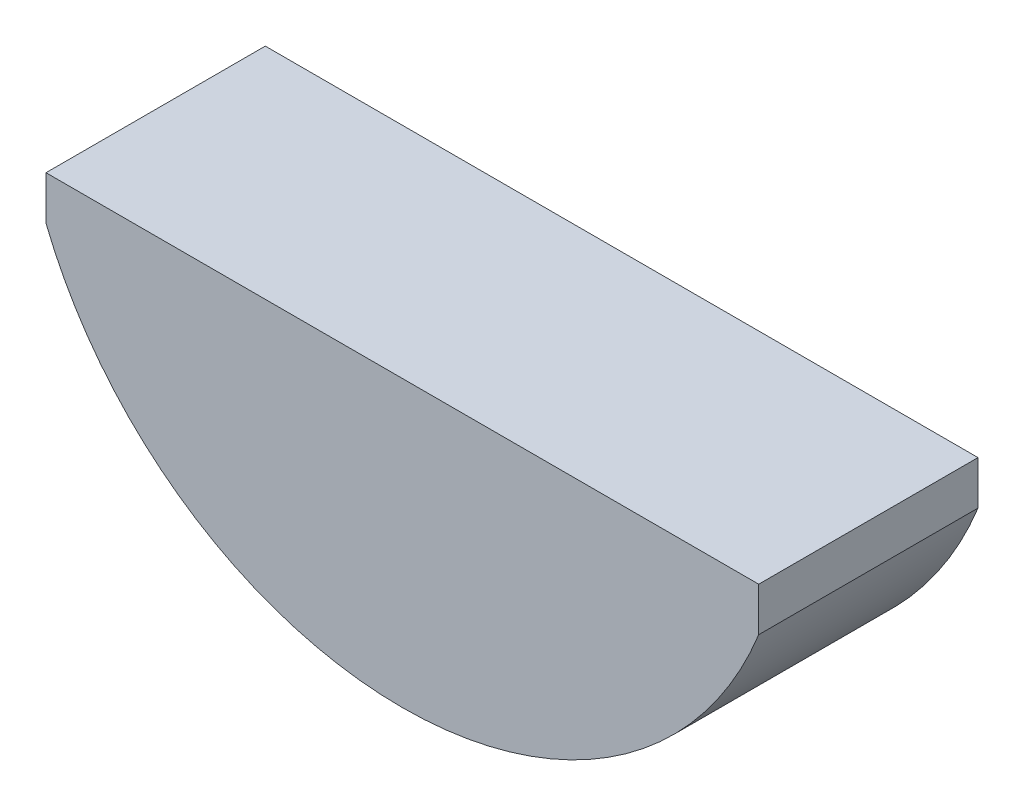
ISO-10303-21;
HEADER;
FILE_DESCRIPTION(('STEP AP214'),'2;1');
FILE_NAME('part.step','',(''),(''),'','','');
FILE_SCHEMA(('AUTOMOTIVE_DESIGN { 1 0 10303 214 1 1 1 1 }'));
ENDSEC;
DATA;
#1=APPLICATION_CONTEXT('core data for automotive mechanical design processes');
#2=APPLICATION_PROTOCOL_DEFINITION('international standard','automotive_design',2000,#1);
#3=PRODUCT_CONTEXT('',#1,'mechanical');
#4=PRODUCT('Part','Part','',(#3));
#5=PRODUCT_RELATED_PRODUCT_CATEGORY('part','',(#4));
#6=PRODUCT_DEFINITION_FORMATION('','',#4);
#7=PRODUCT_DEFINITION_CONTEXT('part definition',#1,'design');
#8=PRODUCT_DEFINITION('design','',#6,#7);
#9=PRODUCT_DEFINITION_SHAPE('','',#8);
#10=(LENGTH_UNIT() NAMED_UNIT(*) SI_UNIT(.MILLI.,.METRE.));
#11=(NAMED_UNIT(*) PLANE_ANGLE_UNIT() SI_UNIT($,.RADIAN.));
#12=(NAMED_UNIT(*) SI_UNIT($,.STERADIAN.) SOLID_ANGLE_UNIT());
#13=UNCERTAINTY_MEASURE_WITH_UNIT(LENGTH_MEASURE(1.E-05),#10,'distance_accuracy_value','');
#14=(GEOMETRIC_REPRESENTATION_CONTEXT(3) GLOBAL_UNCERTAINTY_ASSIGNED_CONTEXT((#13)) GLOBAL_UNIT_ASSIGNED_CONTEXT((#10,
#11,#12)) REPRESENTATION_CONTEXT('',''));
#15=CARTESIAN_POINT('',(0.,0.,0.));
#16=DIRECTION('',(0.,0.,1.));
#17=DIRECTION('',(1.,0.,0.));
#18=AXIS2_PLACEMENT_3D('',#15,#16,#17);
#19=CARTESIAN_POINT('',(1.11022302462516E-13,-4.44089209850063E-13,1.00000000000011));
#20=DIRECTION('',(0.,0.,-1.));
#21=DIRECTION('',(-1.,0.,0.));
#22=AXIS2_PLACEMENT_3D('',#19,#20,#21);
#23=CYLINDRICAL_SURFACE('',#22,3.5);
#24=DIRECTION('',(0.,0.,-1.));
#25=VECTOR('',#24,1.);
#26=CARTESIAN_POINT('',(3.25000000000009,-1.29903810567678,1.00000000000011));
#27=LINE('',#26,#25);
#28=CARTESIAN_POINT('',(3.25000000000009,-1.29903810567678,1.00000000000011));
#29=VERTEX_POINT('',#28);
#30=CARTESIAN_POINT('',(3.25000000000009,-1.299038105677,-0.999999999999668));
#31=VERTEX_POINT('',#30);
#32=EDGE_CURVE('E11',#29,#31,#27,.T.);
#33=ORIENTED_EDGE('',*,*,#32,.F.);
#34=CARTESIAN_POINT('',(1.11022302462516E-13,-4.44089209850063E-13,1.00000000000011));
#35=DIRECTION('',(0.,0.,1.));
#36=DIRECTION('',(1.,0.,0.));
#37=AXIS2_PLACEMENT_3D('',#34,#35,#36);
#38=CIRCLE('',#37,3.5);
#39=CARTESIAN_POINT('',(-3.24999999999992,-1.29903810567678,1.00000000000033));
#40=VERTEX_POINT('',#39);
#41=EDGE_CURVE('E90',#40,#29,#38,.T.);
#42=ORIENTED_EDGE('',*,*,#41,.F.);
#43=DIRECTION('',(0.,0.,-1.));
#44=VECTOR('',#43,1.);
#45=CARTESIAN_POINT('',(-3.24999999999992,-1.29903810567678,1.00000000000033));
#46=LINE('',#45,#44);
#47=CARTESIAN_POINT('',(-3.24999999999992,-1.299038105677,-0.999999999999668));
#48=VERTEX_POINT('',#47);
#49=EDGE_CURVE('E72',#40,#48,#46,.T.);
#50=ORIENTED_EDGE('',*,*,#49,.T.);
#51=CARTESIAN_POINT('',(0.,-2.22044604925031E-13,-0.99999999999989));
#52=DIRECTION('',(0.,0.,1.));
#53=DIRECTION('',(1.,0.,0.));
#54=AXIS2_PLACEMENT_3D('',#51,#52,#53);
#55=CIRCLE('',#54,3.5);
#56=EDGE_CURVE('E84',#48,#31,#55,.T.);
#57=ORIENTED_EDGE('',*,*,#56,.T.);
#58=EDGE_LOOP('',(#33,#42,#50,#57));
#59=FACE_BOUND('',#58,.T.);
#60=ADVANCED_FACE('F30',(#59),#23,.T.);
#61=CARTESIAN_POINT('',(3.25000000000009,-1.29903810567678,1.00000000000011));
#62=DIRECTION('',(-1.,0.,0.));
#63=DIRECTION('',(0.,0.,1.));
#64=AXIS2_PLACEMENT_3D('',#61,#62,#63);
#65=PLANE('',#64);
#66=DIRECTION('',(0.,0.,-1.));
#67=VECTOR('',#66,1.);
#68=CARTESIAN_POINT('',(3.25000000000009,-0.900000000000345,1.00000000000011));
#69=LINE('',#68,#67);
#70=CARTESIAN_POINT('',(3.25000000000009,-0.900000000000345,1.00000000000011));
#71=VERTEX_POINT('',#70);
#72=CARTESIAN_POINT('',(3.25000000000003,-0.900000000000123,-0.999999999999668));
#73=VERTEX_POINT('',#72);
#74=EDGE_CURVE('E39',#71,#73,#69,.T.);
#75=ORIENTED_EDGE('',*,*,#74,.F.);
#76=DIRECTION('',(0.,1.,0.));
#77=VECTOR('',#76,1.);
#78=CARTESIAN_POINT('',(3.25000000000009,-1.29903810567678,1.00000000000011));
#79=LINE('',#78,#77);
#80=EDGE_CURVE('E80',#29,#71,#79,.T.);
#81=ORIENTED_EDGE('',*,*,#80,.F.);
#82=ORIENTED_EDGE('',*,*,#32,.T.);
#83=DIRECTION('',(0.,1.,0.));
#84=VECTOR('',#83,1.);
#85=CARTESIAN_POINT('',(3.25000000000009,-1.299038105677,-0.999999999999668));
#86=LINE('',#85,#84);
#87=EDGE_CURVE('E86',#31,#73,#86,.T.);
#88=ORIENTED_EDGE('',*,*,#87,.T.);
#89=EDGE_LOOP('',(#75,#81,#82,#88));
#90=FACE_BOUND('',#89,.T.);
#91=ADVANCED_FACE('F32',(#90),#65,.F.);
#92=CARTESIAN_POINT('',(-3.24999999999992,-0.900000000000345,1.00000000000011));
#93=DIRECTION('',(0.,1.,0.));
#94=DIRECTION('',(0.,0.,1.));
#95=AXIS2_PLACEMENT_3D('',#92,#93,#94);
#96=PLANE('',#95);
#97=DIRECTION('',(0.,0.,-1.));
#98=VECTOR('',#97,1.);
#99=CARTESIAN_POINT('',(-3.24999999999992,-0.900000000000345,1.00000000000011));
#100=LINE('',#99,#98);
#101=CARTESIAN_POINT('',(-3.24999999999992,-0.900000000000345,1.00000000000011));
#102=VERTEX_POINT('',#101);
#103=CARTESIAN_POINT('',(-3.24999999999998,-0.900000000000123,-0.999999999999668));
#104=VERTEX_POINT('',#103);
#105=EDGE_CURVE('E60',#102,#104,#100,.T.);
#106=ORIENTED_EDGE('',*,*,#105,.F.);
#107=DIRECTION('',(1.,0.,0.));
#108=VECTOR('',#107,1.);
#109=CARTESIAN_POINT('',(-3.24999999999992,-0.900000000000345,1.00000000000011));
#110=LINE('',#109,#108);
#111=EDGE_CURVE('E64',#102,#71,#110,.T.);
#112=ORIENTED_EDGE('',*,*,#111,.T.);
#113=ORIENTED_EDGE('',*,*,#74,.T.);
#114=DIRECTION('',(1.,0.,0.));
#115=VECTOR('',#114,1.);
#116=CARTESIAN_POINT('',(-3.24999999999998,-0.900000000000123,-0.999999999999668));
#117=LINE('',#116,#115);
#118=EDGE_CURVE('E67',#104,#73,#117,.T.);
#119=ORIENTED_EDGE('',*,*,#118,.F.);
#120=EDGE_LOOP('',(#106,#112,#113,#119));
#121=FACE_BOUND('',#120,.T.);
#122=ADVANCED_FACE('F62',(#121),#96,.T.);
#123=CARTESIAN_POINT('',(-3.24999999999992,-1.29903810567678,1.00000000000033));
#124=DIRECTION('',(-1.,0.,0.));
#125=DIRECTION('',(0.,0.,1.));
#126=AXIS2_PLACEMENT_3D('',#123,#124,#125);
#127=PLANE('',#126);
#128=DIRECTION('',(0.,1.,0.));
#129=VECTOR('',#128,1.);
#130=CARTESIAN_POINT('',(-3.24999999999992,-1.29903810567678,1.00000000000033));
#131=LINE('',#130,#129);
#132=EDGE_CURVE('E78',#40,#102,#131,.T.);
#133=ORIENTED_EDGE('',*,*,#132,.T.);
#134=ORIENTED_EDGE('',*,*,#105,.T.);
#135=DIRECTION('',(0.,1.,0.));
#136=VECTOR('',#135,1.);
#137=CARTESIAN_POINT('',(-3.24999999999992,-1.299038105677,-0.999999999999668));
#138=LINE('',#137,#136);
#139=EDGE_CURVE('E98',#48,#104,#138,.T.);
#140=ORIENTED_EDGE('',*,*,#139,.F.);
#141=ORIENTED_EDGE('',*,*,#49,.F.);
#142=EDGE_LOOP('',(#133,#134,#140,#141));
#143=FACE_BOUND('',#142,.T.);
#144=ADVANCED_FACE('F82',(#143),#127,.T.);
#145=CARTESIAN_POINT('',(1.11022302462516E-13,-4.44089209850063E-13,1.00000000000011));
#146=DIRECTION('',(0.,0.,1.));
#147=DIRECTION('',(1.,0.,0.));
#148=AXIS2_PLACEMENT_3D('',#145,#146,#147);
#149=PLANE('',#148);
#150=ORIENTED_EDGE('',*,*,#41,.T.);
#151=ORIENTED_EDGE('',*,*,#80,.T.);
#152=ORIENTED_EDGE('',*,*,#111,.F.);
#153=ORIENTED_EDGE('',*,*,#132,.F.);
#154=EDGE_LOOP('',(#150,#151,#152,#153));
#155=FACE_BOUND('',#154,.T.);
#156=ADVANCED_FACE('F77',(#155),#149,.T.);
#157=CARTESIAN_POINT('',(0.,-2.22044604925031E-13,-0.99999999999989));
#158=DIRECTION('',(0.,0.,1.));
#159=DIRECTION('',(1.,0.,0.));
#160=AXIS2_PLACEMENT_3D('',#157,#158,#159);
#161=PLANE('',#160);
#162=ORIENTED_EDGE('',*,*,#56,.F.);
#163=ORIENTED_EDGE('',*,*,#139,.T.);
#164=ORIENTED_EDGE('',*,*,#118,.T.);
#165=ORIENTED_EDGE('',*,*,#87,.F.);
#166=EDGE_LOOP('',(#162,#163,#164,#165));
#167=FACE_BOUND('',#166,.T.);
#168=ADVANCED_FACE('F97',(#167),#161,.F.);
#169=CLOSED_SHELL('',(#60,#91,#122,#144,#156,#168));
#170=MANIFOLD_SOLID_BREP('B2',#169);
#171=ADVANCED_BREP_SHAPE_REPRESENTATION('',(#18,#170),#14);
#172=SHAPE_DEFINITION_REPRESENTATION(#9,#171);
ENDSEC;
END-ISO-10303-21;
